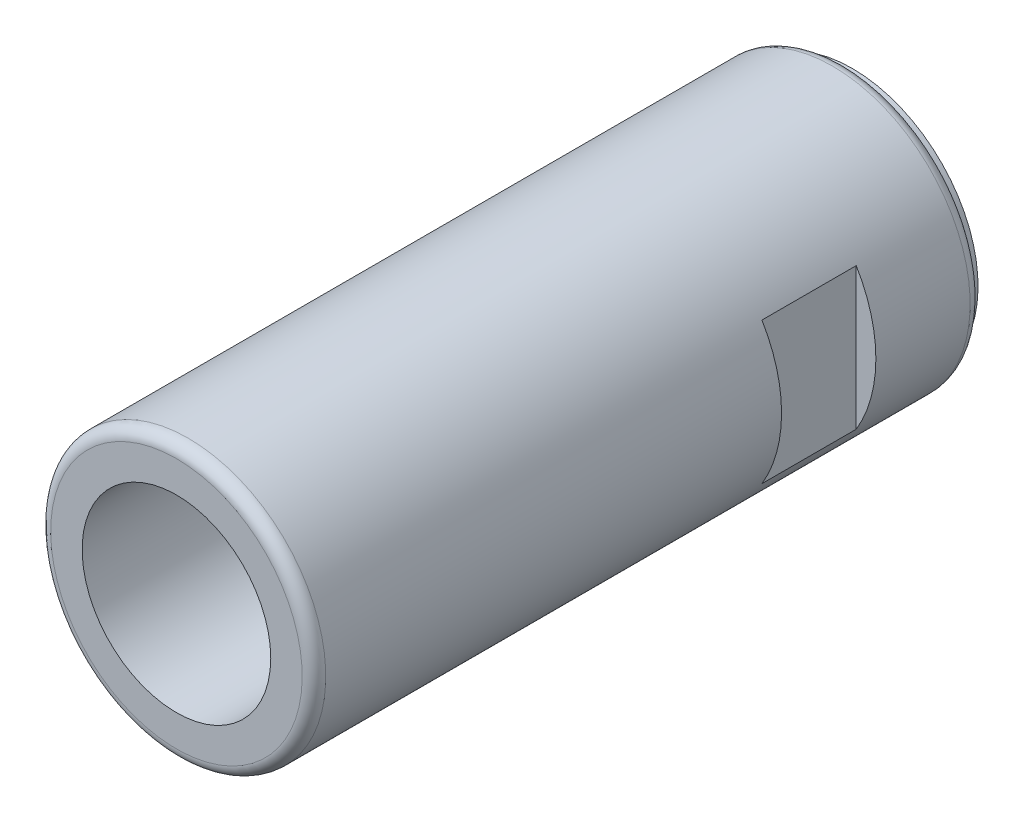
ISO-10303-21;
HEADER;
FILE_DESCRIPTION(('STEP AP214'),'2;1');
FILE_NAME('part.step','',(''),(''),'','','');
FILE_SCHEMA(('AUTOMOTIVE_DESIGN { 1 0 10303 214 1 1 1 1 }'));
ENDSEC;
DATA;
#1=APPLICATION_CONTEXT('core data for automotive mechanical design processes');
#2=APPLICATION_PROTOCOL_DEFINITION('international standard','automotive_design',2000,#1);
#3=PRODUCT_CONTEXT('',#1,'mechanical');
#4=PRODUCT('Part','Part','',(#3));
#5=PRODUCT_RELATED_PRODUCT_CATEGORY('part','',(#4));
#6=PRODUCT_DEFINITION_FORMATION('','',#4);
#7=PRODUCT_DEFINITION_CONTEXT('part definition',#1,'design');
#8=PRODUCT_DEFINITION('design','',#6,#7);
#9=PRODUCT_DEFINITION_SHAPE('','',#8);
#10=(LENGTH_UNIT() NAMED_UNIT(*) SI_UNIT(.MILLI.,.METRE.));
#11=(NAMED_UNIT(*) PLANE_ANGLE_UNIT() SI_UNIT($,.RADIAN.));
#12=(NAMED_UNIT(*) SI_UNIT($,.STERADIAN.) SOLID_ANGLE_UNIT());
#13=UNCERTAINTY_MEASURE_WITH_UNIT(LENGTH_MEASURE(1.E-05),#10,'distance_accuracy_value','');
#14=(GEOMETRIC_REPRESENTATION_CONTEXT(3) GLOBAL_UNCERTAINTY_ASSIGNED_CONTEXT((#13)) GLOBAL_UNIT_ASSIGNED_CONTEXT((#10,
#11,#12)) REPRESENTATION_CONTEXT('',''));
#15=CARTESIAN_POINT('',(0.,0.,0.));
#16=DIRECTION('',(0.,0.,1.));
#17=DIRECTION('',(1.,0.,0.));
#18=AXIS2_PLACEMENT_3D('',#15,#16,#17);
#19=CARTESIAN_POINT('',(0.,0.,0.));
#20=DIRECTION('',(0.,0.,1.));
#21=DIRECTION('',(0.,-1.,0.));
#22=AXIS2_PLACEMENT_3D('',#19,#20,#21);
#23=CYLINDRICAL_SURFACE('',#22,16.);
#24=CARTESIAN_POINT('',(0.,0.,0.));
#25=DIRECTION('',(0.,0.,-1.));
#26=DIRECTION('',(0.,1.,0.));
#27=AXIS2_PLACEMENT_3D('',#24,#25,#26);
#28=CIRCLE('',#27,16.);
#29=CARTESIAN_POINT('',(0.,16.,0.));
#30=VERTEX_POINT('',#29);
#31=EDGE_CURVE('E92',#30,#30,#28,.T.);
#32=ORIENTED_EDGE('',*,*,#31,.F.);
#33=EDGE_LOOP('',(#32));
#34=FACE_BOUND('',#33,.T.);
#35=CARTESIAN_POINT('',(0.,0.,1.));
#36=DIRECTION('',(0.,0.,-1.));
#37=DIRECTION('',(0.,1.,0.));
#38=AXIS2_PLACEMENT_3D('',#35,#36,#37);
#39=CIRCLE('',#38,16.);
#40=CARTESIAN_POINT('',(0.,16.,1.));
#41=VERTEX_POINT('',#40);
#42=EDGE_CURVE('E78',#41,#41,#39,.T.);
#43=ORIENTED_EDGE('',*,*,#42,.T.);
#44=EDGE_LOOP('',(#43));
#45=FACE_BOUND('',#44,.T.);
#46=ADVANCED_FACE('F14',(#34,#45),#23,.T.);
#47=CARTESIAN_POINT('',(0.,0.,0.));
#48=DIRECTION('',(0.,0.,-1.));
#49=DIRECTION('',(0.,1.,0.));
#50=AXIS2_PLACEMENT_3D('',#47,#48,#49);
#51=PLANE('',#50);
#52=CARTESIAN_POINT('',(0.,0.,0.));
#53=DIRECTION('',(0.,0.,1.));
#54=DIRECTION('',(1.,0.,0.));
#55=AXIS2_PLACEMENT_3D('',#52,#53,#54);
#56=CIRCLE('',#55,12.);
#57=CARTESIAN_POINT('',(12.,0.,0.));
#58=VERTEX_POINT('',#57);
#59=EDGE_CURVE('E101',#58,#58,#56,.T.);
#60=ORIENTED_EDGE('',*,*,#59,.T.);
#61=EDGE_LOOP('',(#60));
#62=FACE_BOUND('',#61,.T.);
#63=ORIENTED_EDGE('',*,*,#31,.T.);
#64=EDGE_LOOP('',(#63));
#65=FACE_BOUND('',#64,.T.);
#66=ADVANCED_FACE('F105',(#62,#65),#51,.T.);
#67=CARTESIAN_POINT('',(16.,0.,86.));
#68=DIRECTION('',(0.,0.,1.));
#69=DIRECTION('',(0.,-1.,0.));
#70=AXIS2_PLACEMENT_3D('',#67,#68,#69);
#71=PLANE('',#70);
#72=CARTESIAN_POINT('',(0.,0.,86.));
#73=DIRECTION('',(0.,0.,1.));
#74=DIRECTION('',(1.,0.,0.));
#75=AXIS2_PLACEMENT_3D('',#72,#73,#74);
#76=CIRCLE('',#75,12.);
#77=CARTESIAN_POINT('',(12.,0.,86.));
#78=VERTEX_POINT('',#77);
#79=EDGE_CURVE('E98',#78,#78,#76,.T.);
#80=ORIENTED_EDGE('',*,*,#79,.F.);
#81=EDGE_LOOP('',(#80));
#82=FACE_BOUND('',#81,.T.);
#83=CARTESIAN_POINT('',(0.,0.,86.));
#84=DIRECTION('',(0.,0.,-1.));
#85=DIRECTION('',(0.,1.,0.));
#86=AXIS2_PLACEMENT_3D('',#83,#84,#85);
#87=CIRCLE('',#86,16.);
#88=CARTESIAN_POINT('',(0.,16.,86.));
#89=VERTEX_POINT('',#88);
#90=EDGE_CURVE('E87',#89,#89,#87,.T.);
#91=ORIENTED_EDGE('',*,*,#90,.F.);
#92=EDGE_LOOP('',(#91));
#93=FACE_BOUND('',#92,.T.);
#94=ADVANCED_FACE('F16',(#82,#93),#71,.T.);
#95=CARTESIAN_POINT('',(0.,0.,14.5));
#96=DIRECTION('',(0.,0.,1.));
#97=DIRECTION('',(0.,-1.,0.));
#98=AXIS2_PLACEMENT_3D('',#95,#96,#97);
#99=PLANE('',#98);
#100=DIRECTION('',(0.,-1.,0.));
#101=VECTOR('',#100,1.);
#102=CARTESIAN_POINT('',(-15.,35.,14.5));
#103=LINE('',#102,#101);
#104=CARTESIAN_POINT('',(-15.,9.01387818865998,14.5));
#105=VERTEX_POINT('',#104);
#106=CARTESIAN_POINT('',(-15.,-9.01387818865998,14.5));
#107=VERTEX_POINT('',#106);
#108=EDGE_CURVE('E30',#105,#107,#103,.T.);
#109=ORIENTED_EDGE('',*,*,#108,.F.);
#110=CARTESIAN_POINT('',(0.,0.,14.5));
#111=DIRECTION('',(0.,0.,1.));
#112=DIRECTION('',(0.,-1.,0.));
#113=AXIS2_PLACEMENT_3D('',#110,#111,#112);
#114=CIRCLE('',#113,17.5);
#115=EDGE_CURVE('E54',#107,#105,#114,.F.);
#116=ORIENTED_EDGE('',*,*,#115,.F.);
#117=EDGE_LOOP('',(#109,#116));
#118=FACE_BOUND('',#117,.T.);
#119=ADVANCED_FACE('F55',(#118),#99,.T.);
#120=CARTESIAN_POINT('',(-15.,35.,26.5));
#121=DIRECTION('',(1.,0.,0.));
#122=DIRECTION('',(0.,1.,0.));
#123=AXIS2_PLACEMENT_3D('',#120,#121,#122);
#124=PLANE('',#123);
#125=DIRECTION('',(0.,0.,-1.));
#126=VECTOR('',#125,1.);
#127=CARTESIAN_POINT('',(-15.,-9.01387818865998,1.));
#128=LINE('',#127,#126);
#129=CARTESIAN_POINT('',(-15.,-9.01387818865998,26.5));
#130=VERTEX_POINT('',#129);
#131=EDGE_CURVE('E18',#107,#130,#128,.F.);
#132=ORIENTED_EDGE('',*,*,#131,.T.);
#133=DIRECTION('',(0.,-1.,0.));
#134=VECTOR('',#133,1.);
#135=CARTESIAN_POINT('',(-15.,35.,26.5));
#136=LINE('',#135,#134);
#137=CARTESIAN_POINT('',(-15.,9.01387818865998,26.5));
#138=VERTEX_POINT('',#137);
#139=EDGE_CURVE('E89',#138,#130,#136,.T.);
#140=ORIENTED_EDGE('',*,*,#139,.F.);
#141=DIRECTION('',(0.,0.,-1.));
#142=VECTOR('',#141,1.);
#143=CARTESIAN_POINT('',(-15.,9.01387818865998,1.));
#144=LINE('',#143,#142);
#145=EDGE_CURVE('E59',#138,#105,#144,.T.);
#146=ORIENTED_EDGE('',*,*,#145,.T.);
#147=ORIENTED_EDGE('',*,*,#108,.T.);
#148=EDGE_LOOP('',(#132,#140,#146,#147));
#149=FACE_BOUND('',#148,.T.);
#150=ADVANCED_FACE('F63',(#149),#124,.F.);
#151=CARTESIAN_POINT('',(0.,0.,26.5));
#152=DIRECTION('',(0.,0.,1.));
#153=DIRECTION('',(0.,-1.,0.));
#154=AXIS2_PLACEMENT_3D('',#151,#152,#153);
#155=PLANE('',#154);
#156=CARTESIAN_POINT('',(0.,0.,26.5));
#157=DIRECTION('',(0.,0.,1.));
#158=DIRECTION('',(0.,-1.,0.));
#159=AXIS2_PLACEMENT_3D('',#156,#157,#158);
#160=CIRCLE('',#159,17.5);
#161=EDGE_CURVE('E9',#130,#138,#160,.F.);
#162=ORIENTED_EDGE('',*,*,#161,.T.);
#163=ORIENTED_EDGE('',*,*,#139,.T.);
#164=EDGE_LOOP('',(#162,#163));
#165=FACE_BOUND('',#164,.T.);
#166=ADVANCED_FACE('F134',(#165),#155,.F.);
#167=DIRECTION('',(0.,1.,0.));
#168=VECTOR('',#167,1.);
#169=CARTESIAN_POINT('',(15.,-35.,26.5));
#170=LINE('',#169,#168);
#171=CARTESIAN_POINT('',(15.,-9.01387818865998,26.5));
#172=VERTEX_POINT('',#171);
#173=CARTESIAN_POINT('',(15.,9.01387818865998,26.5));
#174=VERTEX_POINT('',#173);
#175=EDGE_CURVE('E66',#172,#174,#170,.T.);
#176=ORIENTED_EDGE('',*,*,#175,.T.);
#177=EDGE_CURVE('E24',#174,#172,#160,.F.);
#178=ORIENTED_EDGE('',*,*,#177,.T.);
#179=EDGE_LOOP('',(#176,#178));
#180=FACE_BOUND('',#179,.T.);
#181=ADVANCED_FACE('F130',(#180),#155,.F.);
#182=DIRECTION('',(0.,1.,0.));
#183=VECTOR('',#182,1.);
#184=CARTESIAN_POINT('',(15.,-35.,14.5));
#185=LINE('',#184,#183);
#186=CARTESIAN_POINT('',(15.,-9.01387818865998,14.5));
#187=VERTEX_POINT('',#186);
#188=CARTESIAN_POINT('',(15.,9.01387818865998,14.5));
#189=VERTEX_POINT('',#188);
#190=EDGE_CURVE('E37',#187,#189,#185,.T.);
#191=ORIENTED_EDGE('',*,*,#190,.F.);
#192=EDGE_CURVE('E61',#189,#187,#114,.F.);
#193=ORIENTED_EDGE('',*,*,#192,.F.);
#194=EDGE_LOOP('',(#191,#193));
#195=FACE_BOUND('',#194,.T.);
#196=ADVANCED_FACE('F133',(#195),#99,.T.);
#197=CARTESIAN_POINT('',(15.,-35.,26.5));
#198=DIRECTION('',(-1.,0.,0.));
#199=DIRECTION('',(0.,-1.,0.));
#200=AXIS2_PLACEMENT_3D('',#197,#198,#199);
#201=PLANE('',#200);
#202=DIRECTION('',(0.,0.,-1.));
#203=VECTOR('',#202,1.);
#204=CARTESIAN_POINT('',(15.,9.01387818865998,1.));
#205=LINE('',#204,#203);
#206=EDGE_CURVE('E72',#189,#174,#205,.F.);
#207=ORIENTED_EDGE('',*,*,#206,.T.);
#208=ORIENTED_EDGE('',*,*,#175,.F.);
#209=DIRECTION('',(0.,0.,-1.));
#210=VECTOR('',#209,1.);
#211=CARTESIAN_POINT('',(15.,-9.01387818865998,1.));
#212=LINE('',#211,#210);
#213=EDGE_CURVE('E75',#172,#187,#212,.T.);
#214=ORIENTED_EDGE('',*,*,#213,.T.);
#215=ORIENTED_EDGE('',*,*,#190,.T.);
#216=EDGE_LOOP('',(#207,#208,#214,#215));
#217=FACE_BOUND('',#216,.T.);
#218=ADVANCED_FACE('F138',(#217),#201,.F.);
#219=CARTESIAN_POINT('',(0.,0.,84.5));
#220=DIRECTION('',(0.,0.,-1.));
#221=DIRECTION('',(0.,1.,0.));
#222=AXIS2_PLACEMENT_3D('',#219,#220,#221);
#223=TOROIDAL_SURFACE('',#222,16.,1.49999999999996);
#224=ORIENTED_EDGE('',*,*,#90,.T.);
#225=EDGE_LOOP('',(#224));
#226=FACE_BOUND('',#225,.T.);
#227=CARTESIAN_POINT('',(0.,0.,84.5));
#228=DIRECTION('',(0.,0.,-1.));
#229=DIRECTION('',(0.,1.,0.));
#230=AXIS2_PLACEMENT_3D('',#227,#228,#229);
#231=CIRCLE('',#230,17.5);
#232=CARTESIAN_POINT('',(0.,17.5,84.5));
#233=VERTEX_POINT('',#232);
#234=EDGE_CURVE('E84',#233,#233,#231,.T.);
#235=ORIENTED_EDGE('',*,*,#234,.F.);
#236=EDGE_LOOP('',(#235));
#237=FACE_BOUND('',#236,.T.);
#238=ADVANCED_FACE('F143',(#226,#237),#223,.T.);
#239=CARTESIAN_POINT('',(0.,0.,1.));
#240=DIRECTION('',(0.,0.,-1.));
#241=DIRECTION('',(0.,1.,0.));
#242=AXIS2_PLACEMENT_3D('',#239,#240,#241);
#243=CYLINDRICAL_SURFACE('',#242,17.5);
#244=ORIENTED_EDGE('',*,*,#234,.T.);
#245=EDGE_LOOP('',(#244));
#246=FACE_BOUND('',#245,.T.);
#247=ORIENTED_EDGE('',*,*,#206,.F.);
#248=ORIENTED_EDGE('',*,*,#192,.T.);
#249=ORIENTED_EDGE('',*,*,#213,.F.);
#250=ORIENTED_EDGE('',*,*,#177,.F.);
#251=EDGE_LOOP('',(#247,#248,#249,#250));
#252=FACE_BOUND('',#251,.T.);
#253=ORIENTED_EDGE('',*,*,#161,.F.);
#254=ORIENTED_EDGE('',*,*,#131,.F.);
#255=ORIENTED_EDGE('',*,*,#115,.T.);
#256=ORIENTED_EDGE('',*,*,#145,.F.);
#257=EDGE_LOOP('',(#253,#254,#255,#256));
#258=FACE_BOUND('',#257,.T.);
#259=CARTESIAN_POINT('',(0.,0.,2.5));
#260=DIRECTION('',(0.,0.,-1.));
#261=DIRECTION('',(0.,1.,0.));
#262=AXIS2_PLACEMENT_3D('',#259,#260,#261);
#263=CIRCLE('',#262,17.5);
#264=CARTESIAN_POINT('',(0.,17.5,2.5));
#265=VERTEX_POINT('',#264);
#266=EDGE_CURVE('E81',#265,#265,#263,.T.);
#267=ORIENTED_EDGE('',*,*,#266,.F.);
#268=EDGE_LOOP('',(#267));
#269=FACE_BOUND('',#268,.T.);
#270=ADVANCED_FACE('F69',(#246,#252,#258,#269),#243,.T.);
#271=CARTESIAN_POINT('',(0.,0.,2.5));
#272=DIRECTION('',(0.,0.,-1.));
#273=DIRECTION('',(0.,1.,0.));
#274=AXIS2_PLACEMENT_3D('',#271,#272,#273);
#275=TOROIDAL_SURFACE('',#274,16.,1.5);
#276=ORIENTED_EDGE('',*,*,#266,.T.);
#277=EDGE_LOOP('',(#276));
#278=FACE_BOUND('',#277,.T.);
#279=ORIENTED_EDGE('',*,*,#42,.F.);
#280=EDGE_LOOP('',(#279));
#281=FACE_BOUND('',#280,.T.);
#282=ADVANCED_FACE('F110',(#278,#281),#275,.T.);
#283=CARTESIAN_POINT('',(0.,0.,0.));
#284=DIRECTION('',(0.,0.,1.));
#285=DIRECTION('',(1.,0.,0.));
#286=AXIS2_PLACEMENT_3D('',#283,#284,#285);
#287=CYLINDRICAL_SURFACE('',#286,12.);
#288=ORIENTED_EDGE('',*,*,#79,.T.);
#289=EDGE_LOOP('',(#288));
#290=FACE_BOUND('',#289,.T.);
#291=ORIENTED_EDGE('',*,*,#59,.F.);
#292=EDGE_LOOP('',(#291));
#293=FACE_BOUND('',#292,.T.);
#294=ADVANCED_FACE('F108',(#290,#293),#287,.F.);
#295=CLOSED_SHELL('',(#46,#66,#94,#119,#150,#166,#181,#196,#218,#238,#270,#282,#294));
#296=MANIFOLD_SOLID_BREP('B1',#295);
#297=ADVANCED_BREP_SHAPE_REPRESENTATION('',(#18,#296),#14);
#298=SHAPE_DEFINITION_REPRESENTATION(#9,#297);
ENDSEC;
END-ISO-10303-21;
